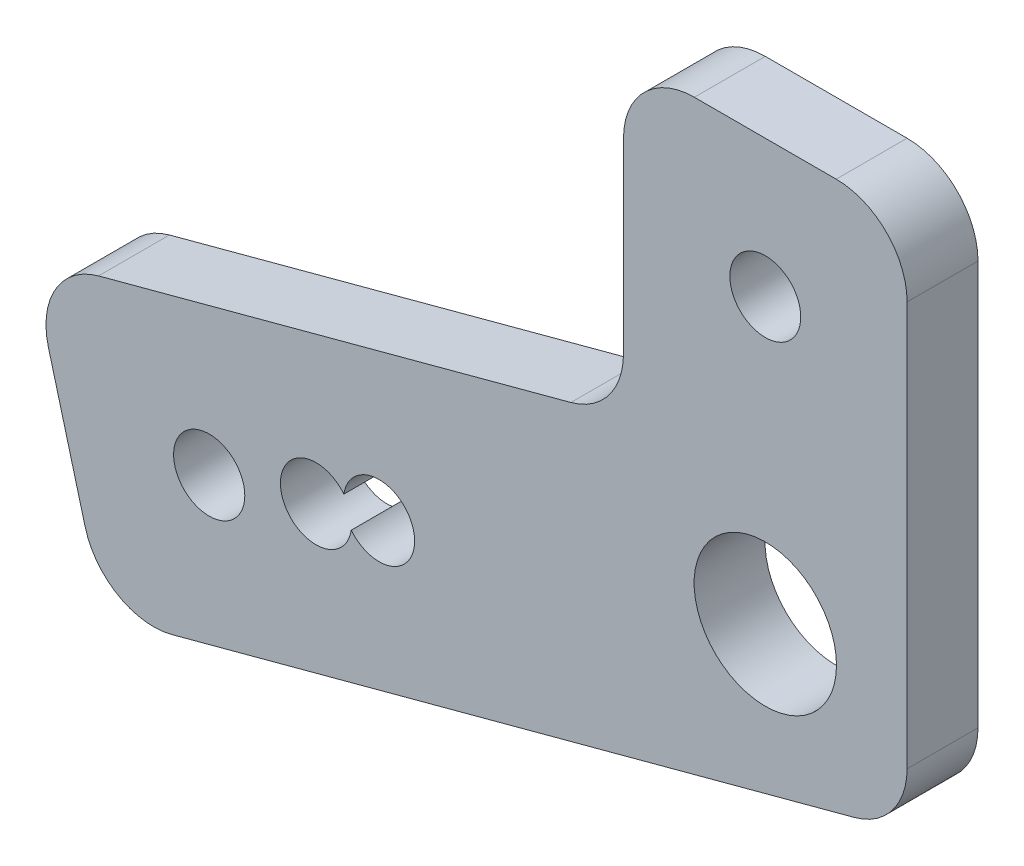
from build123d import *

# Parameters (mm, degrees)
SKETCH1_R           = 3.1877
SKETCH1_R_2         = 6.3754
SKETCH1_R_3         = 3.175
BOSS_EXTRUDE1_DEPTH = 6.35
FILLET1_R           = 6.35


with BuildPart() as part:
    # Sketch1 → Boss-Extrude1 (new body)
    with BuildSketch(Plane.XY):
        Polygon((-12.7, 9.745052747), (-12.7, 37.685052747), (12.7, 37.685052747), (12.7, -9.745052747), (-59.276013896, -29.030967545), (-65.850017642, -4.496451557), align=None)
        with Locations((-49.805067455, -13.345227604)):
            Circle(SKETCH1_R, mode=Mode.SUBTRACT)
        Circle(SKETCH1_R_2, mode=Mode.SUBTRACT)
        with Locations((0, 25.4)):
            Circle(SKETCH1_R_3, mode=Mode.SUBTRACT)
        with BuildLine():
            ThreePointArc((-37.084780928, -11.258260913), (-31.514585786, -8.444307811), (-37.745492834, -8.792450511))
            ThreePointArc((-37.745492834, -8.792450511), (-43.315687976, -11.606403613), (-37.084780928, -11.258260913))
        make_face(mode=Mode.SUBTRACT)
    extrude(amount=BOSS_EXTRUDE1_DEPTH)

    # Fillet1
    fillet1_edges = [part.edges().sort_by_distance(p)[0] for p in [
        (-12.7, 9.745052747, 3.175),
        (-12.7, 37.685052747, 3.175),
        (12.7, 37.685052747, 3.175),
        (12.7, -9.745052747, 3.175),
        (-59.276013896, -29.030967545, 3.175),
        (-65.850017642, -4.496451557, 3.175),
    ]]
    fillet(fillet1_edges, radius=FILLET1_R)


solid = part.part
